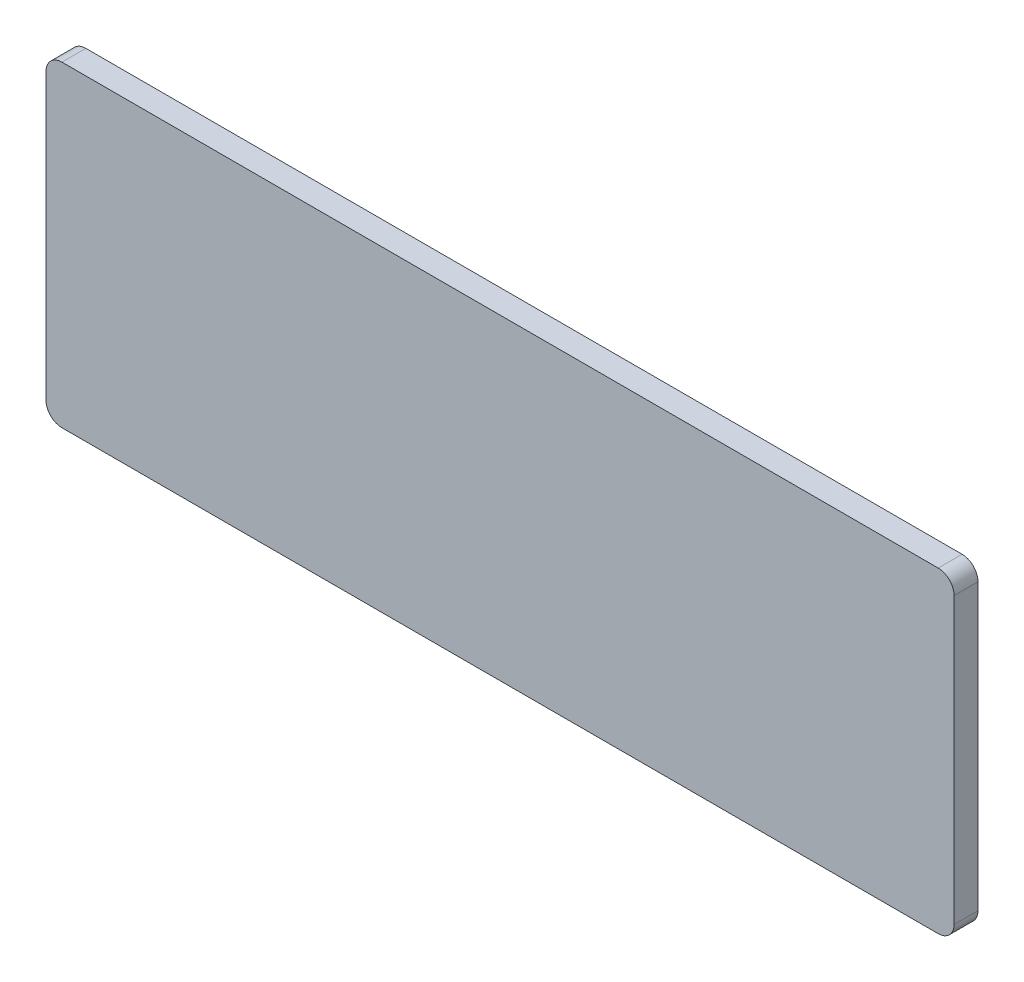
from build123d import *

# Parameters (mm, degrees)
SKETCH1_W           = 114
SKETCH1_H           = 40
BOSS_EXTRUDE1_DEPTH = 3
SKETCH2_W           = 114
SKETCH2_H           = 0.25
CLEARANCE_DEPTH     = 121.851148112
FILLET1_R           = 2


with BuildPart() as part:
    # Sketch1 → Boss-Extrude1 (new body)
    with BuildSketch(Plane.XY):
        with Locations((57, -20)):
            Rectangle(SKETCH1_W, SKETCH1_H)
    extrude(amount=BOSS_EXTRUDE1_DEPTH)

    # Sketch2 → Clearance (cut, through all)
    with BuildSketch(Plane.XY.offset(3)):
        with Locations((57, -39.875)):
            Rectangle(SKETCH2_W, SKETCH2_H)
    extrude(amount=-CLEARANCE_DEPTH, mode=Mode.SUBTRACT)

    # Fillet1
    fillet1_edges = [part.edges().sort_by_distance(p)[0] for p in [
        (0, -39.75, 1.5),
        (114, -39.75, 1.5),
        (0, 0, 1.5),
        (114, 0, 1.5),
    ]]
    fillet(fillet1_edges, radius=FILLET1_R)


solid = part.part
